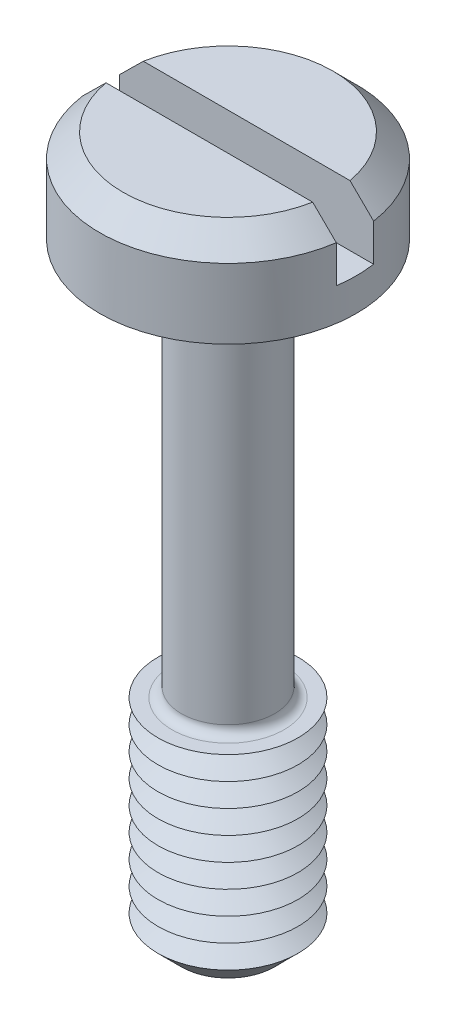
ISO-10303-21;
HEADER;
FILE_DESCRIPTION(('STEP AP214'),'2;1');
FILE_NAME('part.step','',(''),(''),'','','');
FILE_SCHEMA(('AUTOMOTIVE_DESIGN { 1 0 10303 214 1 1 1 1 }'));
ENDSEC;
DATA;
#1=APPLICATION_CONTEXT('core data for automotive mechanical design processes');
#2=APPLICATION_PROTOCOL_DEFINITION('international standard','automotive_design',2000,#1);
#3=PRODUCT_CONTEXT('',#1,'mechanical');
#4=PRODUCT('Part','Part','',(#3));
#5=PRODUCT_RELATED_PRODUCT_CATEGORY('part','',(#4));
#6=PRODUCT_DEFINITION_FORMATION('','',#4);
#7=PRODUCT_DEFINITION_CONTEXT('part definition',#1,'design');
#8=PRODUCT_DEFINITION('design','',#6,#7);
#9=PRODUCT_DEFINITION_SHAPE('','',#8);
#10=(LENGTH_UNIT() NAMED_UNIT(*) SI_UNIT(.MILLI.,.METRE.));
#11=(NAMED_UNIT(*) PLANE_ANGLE_UNIT() SI_UNIT($,.RADIAN.));
#12=(NAMED_UNIT(*) SI_UNIT($,.STERADIAN.) SOLID_ANGLE_UNIT());
#13=UNCERTAINTY_MEASURE_WITH_UNIT(LENGTH_MEASURE(1.E-05),#10,'distance_accuracy_value','');
#14=(GEOMETRIC_REPRESENTATION_CONTEXT(3) GLOBAL_UNCERTAINTY_ASSIGNED_CONTEXT((#13)) GLOBAL_UNIT_ASSIGNED_CONTEXT((#10,
#11,#12)) REPRESENTATION_CONTEXT('',''));
#15=CARTESIAN_POINT('',(0.,0.,0.));
#16=DIRECTION('',(0.,0.,1.));
#17=DIRECTION('',(1.,0.,0.));
#18=AXIS2_PLACEMENT_3D('',#15,#16,#17);
#19=CARTESIAN_POINT('',(0.,2.,0.));
#20=DIRECTION('',(0.,1.,0.));
#21=DIRECTION('',(0.,0.,1.));
#22=AXIS2_PLACEMENT_3D('',#19,#20,#21);
#23=PLANE('',#22);
#24=DIRECTION('',(-1.,0.,0.));
#25=VECTOR('',#24,1.);
#26=CARTESIAN_POINT('',(2.75,2.,-0.4));
#27=LINE('',#26,#25);
#28=CARTESIAN_POINT('',(2.21415898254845,2.,-0.4));
#29=VERTEX_POINT('',#28);
#30=CARTESIAN_POINT('',(-2.21415898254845,2.,-0.4));
#31=VERTEX_POINT('',#30);
#32=EDGE_CURVE('E110',#29,#31,#27,.T.);
#33=ORIENTED_EDGE('',*,*,#32,.F.);
#34=CARTESIAN_POINT('',(0.,2.,0.));
#35=DIRECTION('',(0.,1.,0.));
#36=DIRECTION('',(0.,0.,1.));
#37=AXIS2_PLACEMENT_3D('',#34,#35,#36);
#38=CIRCLE('',#37,2.25);
#39=EDGE_CURVE('E113',#29,#31,#38,.T.);
#40=ORIENTED_EDGE('',*,*,#39,.T.);
#41=EDGE_LOOP('',(#33,#40));
#42=FACE_BOUND('',#41,.T.);
#43=ADVANCED_FACE('F39',(#42),#23,.T.);
#44=CARTESIAN_POINT('',(0.,2.,0.));
#45=DIRECTION('',(0.,-1.,0.));
#46=DIRECTION('',(0.,0.,-1.));
#47=AXIS2_PLACEMENT_3D('',#44,#45,#46);
#48=CONICAL_SURFACE('',#47,2.25,0.785398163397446);
#49=CARTESIAN_POINT('',(6.05060089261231,-1.81380830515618,-0.4));
#50=CARTESIAN_POINT('',(5.84217393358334,-1.60583904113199,-0.4));
#51=CARTESIAN_POINT('',(5.63372707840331,-1.3978896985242,-0.4));
#52=CARTESIAN_POINT('',(5.21676338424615,-0.982052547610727,-0.4));
#53=CARTESIAN_POINT('',(5.00824654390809,-0.774164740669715,-0.4));
#54=CARTESIAN_POINT('',(4.59102343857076,-0.35838342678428,-0.4));
#55=CARTESIAN_POINT('',(4.38231713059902,-0.150489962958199,-0.4));
#56=CARTESIAN_POINT('',(3.96477014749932,0.265153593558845,-0.4));
#57=CARTESIAN_POINT('',(3.75592947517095,0.472903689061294,-0.4));
#58=CARTESIAN_POINT('',(3.33589913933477,0.890287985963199,-0.4));
#59=CARTESIAN_POINT('',(3.12470717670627,1.09991987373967,-0.4));
#60=CARTESIAN_POINT('',(2.70191340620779,1.51879562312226,-0.4));
#61=CARTESIAN_POINT('',(2.49031157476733,1.72803946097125,-0.4));
#62=CARTESIAN_POINT('',(2.17231429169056,2.04123939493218,-0.4));
#63=CARTESIAN_POINT('',(2.06623184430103,2.14551302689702,-0.4));
#64=CARTESIAN_POINT('',(1.85373145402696,2.35372301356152,-0.4));
#65=CARTESIAN_POINT('',(1.7473135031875,2.45765936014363,-0.4));
#66=CARTESIAN_POINT('',(1.53394692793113,2.6649644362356,-0.4));
#67=CARTESIAN_POINT('',(1.42699836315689,2.76833322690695,-0.4));
#68=CARTESIAN_POINT('',(1.26580938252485,2.92258234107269,-0.4));
#69=CARTESIAN_POINT('',(1.21195308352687,2.97386371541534,-0.4));
#70=CARTESIAN_POINT('',(1.10386632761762,3.07603025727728,-0.4));
#71=CARTESIAN_POINT('',(1.0496358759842,3.12691543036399,-0.4));
#72=CARTESIAN_POINT('',(0.96552909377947,3.20495157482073,-0.4));
#73=CARTESIAN_POINT('',(0.935852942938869,3.23231811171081,-0.4));
#74=CARTESIAN_POINT('',(0.876282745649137,3.28681446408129,-0.4));
#75=CARTESIAN_POINT('',(0.846388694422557,3.31394427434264,-0.4));
#76=CARTESIAN_POINT('',(0.786319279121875,3.3678876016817,-0.4));
#77=CARTESIAN_POINT('',(0.756143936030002,3.39470114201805,-0.4));
#78=CARTESIAN_POINT('',(0.695411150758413,3.44788757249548,-0.4));
#79=CARTESIAN_POINT('',(0.664853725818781,3.4742604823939,-0.4));
#80=CARTESIAN_POINT('',(0.58777305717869,3.53947080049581,-0.4));
#81=CARTESIAN_POINT('',(0.540923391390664,3.57793090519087,-0.4));
#82=CARTESIAN_POINT('',(0.469108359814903,3.63368803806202,-0.4));
#83=CARTESIAN_POINT('',(0.4449029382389,3.65195872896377,-0.4));
#84=CARTESIAN_POINT('',(0.395796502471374,3.68753467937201,-0.4));
#85=CARTESIAN_POINT('',(0.370895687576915,3.70484021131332,-0.4));
#86=CARTESIAN_POINT('',(0.315135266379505,3.74129905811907,-0.4));
#87=CARTESIAN_POINT('',(0.284069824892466,3.76014262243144,-0.4));
#88=CARTESIAN_POINT('',(0.220007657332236,3.79429188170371,-0.4));
#89=CARTESIAN_POINT('',(0.187014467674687,3.80960381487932,-0.4));
#90=CARTESIAN_POINT('',(0.12946932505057,3.83013103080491,-0.4));
#91=CARTESIAN_POINT('',(0.105533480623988,3.83700748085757,-0.4));
#92=CARTESIAN_POINT('',(0.0568861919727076,3.84667143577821,-0.4));
#93=CARTESIAN_POINT('',(0.0321777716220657,3.84947323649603,-0.4));
#94=CARTESIAN_POINT('',(-0.0174556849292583,3.85039131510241,-0.4));
#95=CARTESIAN_POINT('',(-0.0423811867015,3.84848412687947,-0.4));
#96=CARTESIAN_POINT('',(-0.0915464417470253,3.8403829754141,-0.4));
#97=CARTESIAN_POINT('',(-0.115784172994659,3.83417751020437,-0.4));
#98=CARTESIAN_POINT('',(-0.16401593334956,3.81830420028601,-0.4));
#99=CARTESIAN_POINT('',(-0.18796977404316,3.80851974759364,-0.4));
#100=CARTESIAN_POINT('',(-0.234812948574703,3.78663483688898,-0.4));
#101=CARTESIAN_POINT('',(-0.257700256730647,3.77453017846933,-0.4));
#102=CARTESIAN_POINT('',(-0.302761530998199,3.74868049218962,-0.4));
#103=CARTESIAN_POINT('',(-0.32492813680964,3.73492286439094,-0.4));
#104=CARTESIAN_POINT('',(-0.368536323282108,3.70635481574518,-0.4));
#105=CARTESIAN_POINT('',(-0.389978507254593,3.69154530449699,-0.4));
#106=CARTESIAN_POINT('',(-0.457169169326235,3.64340388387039,-0.4));
#107=CARTESIAN_POINT('',(-0.501937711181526,3.60871473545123,-0.4));
#108=CARTESIAN_POINT('',(-0.590074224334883,3.53759028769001,-0.4));
#109=CARTESIAN_POINT('',(-0.633441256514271,3.50115385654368,-0.4));
#110=CARTESIAN_POINT('',(-0.719371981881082,3.42718980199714,-0.4));
#111=CARTESIAN_POINT('',(-0.761934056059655,3.3896603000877,-0.4));
#112=CARTESIAN_POINT('',(-0.846465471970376,3.31396862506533,-0.4));
#113=CARTESIAN_POINT('',(-0.888434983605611,3.27580664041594,-0.4));
#114=CARTESIAN_POINT('',(-1.01351008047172,3.16091722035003,-0.4));
#115=CARTESIAN_POINT('',(-1.09603733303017,3.0835613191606,-0.4));
#116=CARTESIAN_POINT('',(-1.26020205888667,2.92809304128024,-0.4));
#117=CARTESIAN_POINT('',(-1.34184039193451,2.84998156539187,-0.4));
#118=CARTESIAN_POINT('',(-1.50425180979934,2.69362860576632,-0.4));
#119=CARTESIAN_POINT('',(-1.58502715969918,2.61538947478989,-0.4));
#120=CARTESIAN_POINT('',(-1.74627332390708,2.45859784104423,-0.4));
#121=CARTESIAN_POINT('',(-1.82674413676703,2.38004533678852,-0.4));
#122=CARTESIAN_POINT('',(-2.06785619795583,2.14407469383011,-0.4));
#123=CARTESIAN_POINT('',(-2.22819388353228,1.98634651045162,-0.4));
#124=CARTESIAN_POINT('',(-2.54852691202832,1.67040441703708,-0.4));
#125=CARTESIAN_POINT('',(-2.70852207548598,1.51219032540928,-0.4));
#126=CARTESIAN_POINT('',(-3.02826273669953,1.19551306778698,-0.4));
#127=CARTESIAN_POINT('',(-3.18800823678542,1.03704990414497,-0.4));
#128=CARTESIAN_POINT('',(-3.66699080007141,0.561455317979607,-0.4));
#129=CARTESIAN_POINT('',(-3.9859992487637,0.244093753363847,-0.4));
#130=CARTESIAN_POINT('',(-4.6236988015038,-0.390879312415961,-0.4));
#131=CARTESIAN_POINT('',(-4.94238993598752,-0.70849078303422,-0.4));
#132=CARTESIAN_POINT('',(-5.39262624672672,-1.15743192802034,-0.4));
#133=CARTESIAN_POINT('',(-5.52423897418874,-1.28869385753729,-0.4));
#134=CARTESIAN_POINT('',(-5.78743776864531,-1.5512369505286,-0.4));
#135=CARTESIAN_POINT('',(-5.91902383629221,-1.68251811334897,-0.4));
#136=CARTESIAN_POINT('',(-6.05060089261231,-1.81380830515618,-0.4));
#137=B_SPLINE_CURVE_WITH_KNOTS('',3,(#49,#50,#51,#52,#53,#54,#55,#56,#57,#58,#59,#60,#61,#62,
#63,#64,#65,#66,#67,#68,#69,#70,#71,#72,#73,#74,#75,#76,#77,#78,#79,#80,#81,#82,#83,#84,#85,#86,
#87,#88,#89,#90,#91,#92,#93,#94,#95,#96,#97,#98,#99,#100,#101,#102,#103,#104,#105,#106,#107,
#108,#109,#110,#111,#112,#113,#114,#115,#116,#117,#118,#119,#120,#121,#122,#123,#124,#125,#126,
#127,#128,#129,#130,#131,#132,#133,#134,#135,#136),.UNSPECIFIED.,.F.,.F.,(4,2,2,2,2,2,2,2,2,2,2,
2,2,2,2,2,2,2,2,2,2,2,2,2,2,2,2,2,2,2,2,2,2,2,2,2,2,2,2,2,2,2,2,4),(0.,0.88331033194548,
1.76663897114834,2.65038219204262,3.53410755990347,4.42681573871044,5.31957687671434,
5.76582544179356,6.21208466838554,6.65829482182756,6.88139126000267,7.10448455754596,
7.22558850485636,7.34669511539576,7.46779276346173,7.58888496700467,7.77066509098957,
7.86163037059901,7.95256984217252,8.06146372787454,8.17016376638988,8.24461141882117,
8.31879723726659,8.39335348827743,8.46811002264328,8.54555790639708,8.62314734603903,
8.70137101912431,8.77952785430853,8.94932745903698,9.1192385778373,9.28946128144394,
9.45963414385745,9.79895964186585,10.1379210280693,10.475282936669,10.8126464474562,
11.4873867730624,12.1624208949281,12.8374486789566,14.1873973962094,15.5372009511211,
16.0948428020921,16.6524687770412),.UNSPECIFIED.);
#138=CARTESIAN_POINT('',(2.72075357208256,1.5,-0.4));
#139=VERTEX_POINT('',#138);
#140=EDGE_CURVE('E260',#139,#29,#137,.T.);
#141=ORIENTED_EDGE('',*,*,#140,.F.);
#142=CARTESIAN_POINT('',(0.,1.5,0.));
#143=DIRECTION('',(0.,1.,0.));
#144=DIRECTION('',(0.,0.,1.));
#145=AXIS2_PLACEMENT_3D('',#142,#143,#144);
#146=CIRCLE('',#145,2.75);
#147=CARTESIAN_POINT('',(-2.72075357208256,1.5,-0.4));
#148=VERTEX_POINT('',#147);
#149=EDGE_CURVE('E128',#148,#139,#146,.F.);
#150=ORIENTED_EDGE('',*,*,#149,.F.);
#151=EDGE_CURVE('E102',#31,#148,#137,.T.);
#152=ORIENTED_EDGE('',*,*,#151,.F.);
#153=ORIENTED_EDGE('',*,*,#39,.F.);
#154=EDGE_LOOP('',(#141,#150,#152,#153));
#155=FACE_BOUND('',#154,.T.);
#156=ADVANCED_FACE('F222',(#155),#48,.T.);
#157=CARTESIAN_POINT('',(0.,-13.,0.));
#158=DIRECTION('',(0.,1.,0.));
#159=DIRECTION('',(0.,0.,1.));
#160=AXIS2_PLACEMENT_3D('',#157,#158,#159);
#161=CYLINDRICAL_SURFACE('',#160,1.);
#162=CARTESIAN_POINT('',(0.,-8.3,0.));
#163=DIRECTION('',(0.,-1.,0.));
#164=DIRECTION('',(0.,0.,-1.));
#165=AXIS2_PLACEMENT_3D('',#162,#163,#164);
#166=CIRCLE('',#165,1.);
#167=CARTESIAN_POINT('',(0.,-8.3,1.));
#168=VERTEX_POINT('',#167);
#169=EDGE_CURVE('E123',#168,#168,#166,.F.);
#170=CARTESIAN_POINT('',(0.,-0.200000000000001,0.));
#171=DIRECTION('',(0.,1.,0.));
#172=DIRECTION('',(0.,0.,1.));
#173=AXIS2_PLACEMENT_3D('',#170,#171,#172);
#174=CIRCLE('',#173,1.);
#175=CARTESIAN_POINT('',(0.,-0.200000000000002,1.));
#176=VERTEX_POINT('',#175);
#177=EDGE_CURVE('E365',#176,#176,#174,.F.);
#178=CARTESIAN_POINT('',(0.,-8.3,1.));
#179=CARTESIAN_POINT('',(0.,-8.215625,1.));
#180=CARTESIAN_POINT('',(0.,-8.13125,1.));
#181=CARTESIAN_POINT('',(0.,-7.9625,1.));
#182=CARTESIAN_POINT('',(0.,-7.878125,1.));
#183=CARTESIAN_POINT('',(0.,-7.709375,1.));
#184=CARTESIAN_POINT('',(0.,-7.625,1.));
#185=CARTESIAN_POINT('',(0.,-7.45625,1.));
#186=CARTESIAN_POINT('',(0.,-7.371875,1.));
#187=CARTESIAN_POINT('',(0.,-7.203125,1.));
#188=CARTESIAN_POINT('',(0.,-7.11875,1.));
#189=CARTESIAN_POINT('',(0.,-6.95,1.));
#190=CARTESIAN_POINT('',(0.,-6.865625,1.));
#191=CARTESIAN_POINT('',(0.,-6.696875,1.));
#192=CARTESIAN_POINT('',(0.,-6.6125,1.));
#193=CARTESIAN_POINT('',(0.,-6.44375,1.));
#194=CARTESIAN_POINT('',(0.,-6.359375,1.));
#195=CARTESIAN_POINT('',(0.,-6.190625,1.));
#196=CARTESIAN_POINT('',(0.,-6.10625,1.));
#197=CARTESIAN_POINT('',(0.,-5.9375,1.));
#198=CARTESIAN_POINT('',(0.,-5.853125,1.));
#199=CARTESIAN_POINT('',(0.,-5.684375,1.));
#200=CARTESIAN_POINT('',(0.,-5.6,1.));
#201=CARTESIAN_POINT('',(0.,-5.43125,1.));
#202=CARTESIAN_POINT('',(0.,-5.346875,1.));
#203=CARTESIAN_POINT('',(0.,-5.178125,1.));
#204=CARTESIAN_POINT('',(0.,-5.09375,1.));
#205=CARTESIAN_POINT('',(0.,-4.925,1.));
#206=CARTESIAN_POINT('',(0.,-4.840625,1.));
#207=CARTESIAN_POINT('',(0.,-4.671875,1.));
#208=CARTESIAN_POINT('',(0.,-4.5875,1.));
#209=CARTESIAN_POINT('',(0.,-4.41875,1.));
#210=CARTESIAN_POINT('',(0.,-4.334375,1.));
#211=CARTESIAN_POINT('',(0.,-4.165625,1.));
#212=CARTESIAN_POINT('',(0.,-4.08125,1.));
#213=CARTESIAN_POINT('',(0.,-3.9125,1.));
#214=CARTESIAN_POINT('',(0.,-3.828125,1.));
#215=CARTESIAN_POINT('',(0.,-3.659375,1.));
#216=CARTESIAN_POINT('',(0.,-3.575,1.));
#217=CARTESIAN_POINT('',(0.,-3.40625,1.));
#218=CARTESIAN_POINT('',(0.,-3.321875,1.));
#219=CARTESIAN_POINT('',(0.,-3.153125,1.));
#220=CARTESIAN_POINT('',(0.,-3.06875,1.));
#221=CARTESIAN_POINT('',(0.,-2.9,1.));
#222=CARTESIAN_POINT('',(0.,-2.815625,1.));
#223=CARTESIAN_POINT('',(0.,-2.646875,1.));
#224=CARTESIAN_POINT('',(0.,-2.5625,1.));
#225=CARTESIAN_POINT('',(0.,-2.39375,1.));
#226=CARTESIAN_POINT('',(0.,-2.309375,1.));
#227=CARTESIAN_POINT('',(0.,-2.140625,1.));
#228=CARTESIAN_POINT('',(0.,-2.05625,1.));
#229=CARTESIAN_POINT('',(0.,-1.8875,1.));
#230=CARTESIAN_POINT('',(0.,-1.803125,1.));
#231=CARTESIAN_POINT('',(0.,-1.634375,1.));
#232=CARTESIAN_POINT('',(0.,-1.55,1.));
#233=CARTESIAN_POINT('',(0.,-1.38125,1.));
#234=CARTESIAN_POINT('',(0.,-1.296875,1.));
#235=CARTESIAN_POINT('',(0.,-1.128125,1.));
#236=CARTESIAN_POINT('',(0.,-1.04375,1.));
#237=CARTESIAN_POINT('',(0.,-0.875000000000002,1.));
#238=CARTESIAN_POINT('',(0.,-0.790625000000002,1.));
#239=CARTESIAN_POINT('',(0.,-0.621875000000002,1.));
#240=CARTESIAN_POINT('',(0.,-0.537500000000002,1.));
#241=CARTESIAN_POINT('',(0.,-0.368750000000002,1.));
#242=CARTESIAN_POINT('',(0.,-0.284375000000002,1.));
#243=CARTESIAN_POINT('',(0.,-0.200000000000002,1.));
#244=B_SPLINE_CURVE_WITH_KNOTS('',3,(#178,#179,#180,#181,#182,#183,#184,#185,#186,#187,#188,
#189,#190,#191,#192,#193,#194,#195,#196,#197,#198,#199,#200,#201,#202,#203,#204,#205,#206,#207,
#208,#209,#210,#211,#212,#213,#214,#215,#216,#217,#218,#219,#220,#221,#222,#223,#224,#225,#226,
#227,#228,#229,#230,#231,#232,#233,#234,#235,#236,#237,#238,#239,#240,#241,#242,#243),
.UNSPECIFIED.,.F.,.F.,(4,2,2,2,2,2,2,2,2,2,2,2,2,2,2,2,2,2,2,2,2,2,2,2,2,2,2,2,2,2,2,2,4),(0.,
0.253125,0.506249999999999,0.759374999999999,1.0125,1.265625,1.51875,1.771875,2.025,2.278125,
2.53125,2.784375,3.0375,3.290625,3.54375,3.796875,4.05,4.303125,4.55625,4.809375,5.0625,
5.315625,5.56875,5.821875,6.075,6.328125,6.58125,6.834375,7.0875,7.340625,7.59375,7.846875,8.1),.UNSPECIFIED.);
#245=EDGE_CURVE('BSEAM218',#168,#176,#244,.T.);
#246=ORIENTED_EDGE('',*,*,#169,.T.);
#247=ORIENTED_EDGE('',*,*,#177,.T.);
#248=ORIENTED_EDGE('',*,*,#245,.T.);
#249=ORIENTED_EDGE('',*,*,#245,.F.);
#250=EDGE_LOOP('',(#246,#248,#247,#249));
#251=FACE_BOUND('',#250,.T.);
#252=ADVANCED_FACE('F218',(#251),#161,.T.);
#253=CARTESIAN_POINT('',(0.,2.,0.));
#254=DIRECTION('',(0.,-1.,0.));
#255=DIRECTION('',(0.,0.,-1.));
#256=AXIS2_PLACEMENT_3D('',#253,#254,#255);
#257=CYLINDRICAL_SURFACE('',#256,2.75);
#258=ORIENTED_EDGE('',*,*,#149,.T.);
#259=DIRECTION('',(0.,-1.,0.));
#260=VECTOR('',#259,1.);
#261=CARTESIAN_POINT('',(2.72075357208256,2.,-0.4));
#262=LINE('',#261,#260);
#263=CARTESIAN_POINT('',(2.72075357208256,0.7,-0.4));
#264=VERTEX_POINT('',#263);
#265=EDGE_CURVE('E64',#139,#264,#262,.T.);
#266=ORIENTED_EDGE('',*,*,#265,.T.);
#267=CARTESIAN_POINT('',(0.,0.7,0.));
#268=DIRECTION('',(0.,1.,0.));
#269=DIRECTION('',(0.,0.,1.));
#270=AXIS2_PLACEMENT_3D('',#267,#268,#269);
#271=CIRCLE('',#270,2.75);
#272=CARTESIAN_POINT('',(2.72075357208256,0.7,0.4));
#273=VERTEX_POINT('',#272);
#274=EDGE_CURVE('E11',#273,#264,#271,.T.);
#275=ORIENTED_EDGE('',*,*,#274,.F.);
#276=DIRECTION('',(0.,-1.,0.));
#277=VECTOR('',#276,1.);
#278=CARTESIAN_POINT('',(2.72075357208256,2.,0.4));
#279=LINE('',#278,#277);
#280=CARTESIAN_POINT('',(2.72075357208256,1.5,0.4));
#281=VERTEX_POINT('',#280);
#282=EDGE_CURVE('E279',#273,#281,#279,.F.);
#283=ORIENTED_EDGE('',*,*,#282,.T.);
#284=CARTESIAN_POINT('',(-2.72075357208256,1.5,0.4));
#285=VERTEX_POINT('',#284);
#286=EDGE_CURVE('E120',#281,#285,#146,.F.);
#287=ORIENTED_EDGE('',*,*,#286,.T.);
#288=DIRECTION('',(0.,-1.,0.));
#289=VECTOR('',#288,1.);
#290=CARTESIAN_POINT('',(-2.72075357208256,2.,0.4));
#291=LINE('',#290,#289);
#292=CARTESIAN_POINT('',(-2.72075357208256,0.7,0.4));
#293=VERTEX_POINT('',#292);
#294=EDGE_CURVE('E96',#285,#293,#291,.T.);
#295=ORIENTED_EDGE('',*,*,#294,.T.);
#296=CARTESIAN_POINT('',(-2.72075357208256,0.7,-0.4));
#297=VERTEX_POINT('',#296);
#298=EDGE_CURVE('E44',#297,#293,#271,.T.);
#299=ORIENTED_EDGE('',*,*,#298,.F.);
#300=DIRECTION('',(0.,-1.,0.));
#301=VECTOR('',#300,1.);
#302=CARTESIAN_POINT('',(-2.72075357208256,2.,-0.4));
#303=LINE('',#302,#301);
#304=EDGE_CURVE('E283',#297,#148,#303,.F.);
#305=ORIENTED_EDGE('',*,*,#304,.T.);
#306=EDGE_LOOP('',(#258,#266,#275,#283,#287,#295,#299,#305));
#307=FACE_BOUND('',#306,.T.);
#308=CARTESIAN_POINT('',(0.,0.,0.));
#309=DIRECTION('',(0.,1.,0.));
#310=DIRECTION('',(0.,0.,1.));
#311=AXIS2_PLACEMENT_3D('',#308,#309,#310);
#312=CIRCLE('',#311,2.75);
#313=CARTESIAN_POINT('',(0.,0.,2.75));
#314=VERTEX_POINT('',#313);
#315=EDGE_CURVE('E354',#314,#314,#312,.T.);
#316=ORIENTED_EDGE('',*,*,#315,.T.);
#317=EDGE_LOOP('',(#316));
#318=FACE_BOUND('',#317,.T.);
#319=ADVANCED_FACE('F221',(#307,#318),#257,.T.);
#320=DIRECTION('',(1.,0.,0.));
#321=VECTOR('',#320,1.);
#322=CARTESIAN_POINT('',(2.75,2.,0.4));
#323=LINE('',#322,#321);
#324=CARTESIAN_POINT('',(-2.21415898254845,2.,0.4));
#325=VERTEX_POINT('',#324);
#326=CARTESIAN_POINT('',(2.21415898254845,2.,0.4));
#327=VERTEX_POINT('',#326);
#328=EDGE_CURVE('E56',#325,#327,#323,.T.);
#329=ORIENTED_EDGE('',*,*,#328,.F.);
#330=EDGE_CURVE('E108',#325,#327,#38,.T.);
#331=ORIENTED_EDGE('',*,*,#330,.T.);
#332=EDGE_LOOP('',(#329,#331));
#333=FACE_BOUND('',#332,.T.);
#334=ADVANCED_FACE('F107',(#333),#23,.T.);
#335=CARTESIAN_POINT('',(0.,0.,0.));
#336=DIRECTION('',(0.,1.,0.));
#337=DIRECTION('',(0.,0.,1.));
#338=AXIS2_PLACEMENT_3D('',#335,#336,#337);
#339=PLANE('',#338);
#340=CARTESIAN_POINT('',(0.,0.,0.));
#341=DIRECTION('',(0.,1.,0.));
#342=DIRECTION('',(0.,0.,1.));
#343=AXIS2_PLACEMENT_3D('',#340,#341,#342);
#344=CIRCLE('',#343,1.2);
#345=CARTESIAN_POINT('',(0.,0.,1.2));
#346=VERTEX_POINT('',#345);
#347=EDGE_CURVE('E114',#346,#346,#344,.T.);
#348=ORIENTED_EDGE('',*,*,#347,.T.);
#349=EDGE_LOOP('',(#348));
#350=FACE_BOUND('',#349,.T.);
#351=ORIENTED_EDGE('',*,*,#315,.F.);
#352=EDGE_LOOP('',(#351));
#353=FACE_BOUND('',#352,.T.);
#354=ADVANCED_FACE('F212',(#350,#353),#339,.F.);
#355=CARTESIAN_POINT('',(0.,-8.5,0.));
#356=DIRECTION('',(0.,-1.,0.));
#357=DIRECTION('',(0.,0.,-1.));
#358=AXIS2_PLACEMENT_3D('',#355,#356,#357);
#359=PLANE('',#358);
#360=CARTESIAN_POINT('',(0.,-8.5,0.));
#361=DIRECTION('',(0.,-1.,0.));
#362=DIRECTION('',(0.,0.,-1.));
#363=AXIS2_PLACEMENT_3D('',#360,#361,#362);
#364=CIRCLE('',#363,1.2);
#365=CARTESIAN_POINT('',(0.,-8.5,-1.2));
#366=VERTEX_POINT('',#365);
#367=EDGE_CURVE('E361',#366,#366,#364,.T.);
#368=ORIENTED_EDGE('',*,*,#367,.T.);
#369=EDGE_LOOP('',(#368));
#370=FACE_BOUND('',#369,.T.);
#371=CARTESIAN_POINT('',(0.,-8.5,0.));
#372=DIRECTION('',(0.,1.,0.));
#373=DIRECTION('',(0.,0.,1.));
#374=AXIS2_PLACEMENT_3D('',#371,#372,#373);
#375=CIRCLE('',#374,1.5);
#376=CARTESIAN_POINT('',(0.,-8.5,1.5));
#377=VERTEX_POINT('',#376);
#378=EDGE_CURVE('E350',#377,#377,#375,.T.);
#379=ORIENTED_EDGE('',*,*,#378,.T.);
#380=EDGE_LOOP('',(#379));
#381=FACE_BOUND('',#380,.T.);
#382=ADVANCED_FACE('F208',(#370,#381),#359,.F.);
#383=CARTESIAN_POINT('',(0.,-8.75,0.));
#384=DIRECTION('',(0.,1.,0.));
#385=DIRECTION('',(0.,0.,1.));
#386=AXIS2_PLACEMENT_3D('',#383,#384,#385);
#387=CONICAL_SURFACE('',#386,1.06698729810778,1.0471975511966);
#388=ORIENTED_EDGE('',*,*,#378,.F.);
#389=EDGE_LOOP('',(#388));
#390=FACE_BOUND('',#389,.T.);
#391=CARTESIAN_POINT('',(0.,-8.75,0.));
#392=DIRECTION('',(0.,1.,0.));
#393=DIRECTION('',(0.,0.,1.));
#394=AXIS2_PLACEMENT_3D('',#391,#392,#393);
#395=CIRCLE('',#394,1.06698729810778);
#396=CARTESIAN_POINT('',(0.,-8.75,1.06698729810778));
#397=VERTEX_POINT('',#396);
#398=EDGE_CURVE('E346',#397,#397,#395,.T.);
#399=ORIENTED_EDGE('',*,*,#398,.T.);
#400=EDGE_LOOP('',(#399));
#401=FACE_BOUND('',#400,.T.);
#402=ADVANCED_FACE('F204',(#390,#401),#387,.T.);
#403=CARTESIAN_POINT('',(0.,-9.,0.));
#404=DIRECTION('',(0.,-1.,0.));
#405=DIRECTION('',(0.,0.,-1.));
#406=AXIS2_PLACEMENT_3D('',#403,#404,#405);
#407=CONICAL_SURFACE('',#406,1.5,1.0471975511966);
#408=ORIENTED_EDGE('',*,*,#398,.F.);
#409=EDGE_LOOP('',(#408));
#410=FACE_BOUND('',#409,.T.);
#411=CARTESIAN_POINT('',(0.,-9.,0.));
#412=DIRECTION('',(0.,1.,0.));
#413=DIRECTION('',(0.,0.,1.));
#414=AXIS2_PLACEMENT_3D('',#411,#412,#413);
#415=CIRCLE('',#414,1.5);
#416=CARTESIAN_POINT('',(0.,-9.,1.5));
#417=VERTEX_POINT('',#416);
#418=EDGE_CURVE('E343',#417,#417,#415,.T.);
#419=ORIENTED_EDGE('',*,*,#418,.T.);
#420=EDGE_LOOP('',(#419));
#421=FACE_BOUND('',#420,.T.);
#422=ADVANCED_FACE('F200',(#410,#421),#407,.T.);
#423=CARTESIAN_POINT('',(0.,-9.25,0.));
#424=DIRECTION('',(0.,1.,0.));
#425=DIRECTION('',(0.,0.,1.));
#426=AXIS2_PLACEMENT_3D('',#423,#424,#425);
#427=CONICAL_SURFACE('',#426,1.06698729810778,1.0471975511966);
#428=ORIENTED_EDGE('',*,*,#418,.F.);
#429=EDGE_LOOP('',(#428));
#430=FACE_BOUND('',#429,.T.);
#431=CARTESIAN_POINT('',(0.,-9.25,0.));
#432=DIRECTION('',(0.,1.,0.));
#433=DIRECTION('',(0.,0.,1.));
#434=AXIS2_PLACEMENT_3D('',#431,#432,#433);
#435=CIRCLE('',#434,1.06698729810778);
#436=CARTESIAN_POINT('',(0.,-9.25,1.06698729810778));
#437=VERTEX_POINT('',#436);
#438=EDGE_CURVE('E340',#437,#437,#435,.T.);
#439=ORIENTED_EDGE('',*,*,#438,.T.);
#440=EDGE_LOOP('',(#439));
#441=FACE_BOUND('',#440,.T.);
#442=ADVANCED_FACE('F196',(#430,#441),#427,.T.);
#443=CARTESIAN_POINT('',(0.,-9.5,0.));
#444=DIRECTION('',(0.,-1.,0.));
#445=DIRECTION('',(0.,0.,-1.));
#446=AXIS2_PLACEMENT_3D('',#443,#444,#445);
#447=CONICAL_SURFACE('',#446,1.5,1.0471975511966);
#448=ORIENTED_EDGE('',*,*,#438,.F.);
#449=EDGE_LOOP('',(#448));
#450=FACE_BOUND('',#449,.T.);
#451=CARTESIAN_POINT('',(0.,-9.5,0.));
#452=DIRECTION('',(0.,1.,0.));
#453=DIRECTION('',(0.,0.,1.));
#454=AXIS2_PLACEMENT_3D('',#451,#452,#453);
#455=CIRCLE('',#454,1.5);
#456=CARTESIAN_POINT('',(0.,-9.5,1.5));
#457=VERTEX_POINT('',#456);
#458=EDGE_CURVE('E337',#457,#457,#455,.T.);
#459=ORIENTED_EDGE('',*,*,#458,.T.);
#460=EDGE_LOOP('',(#459));
#461=FACE_BOUND('',#460,.T.);
#462=ADVANCED_FACE('F192',(#450,#461),#447,.T.);
#463=CARTESIAN_POINT('',(0.,-9.75,0.));
#464=DIRECTION('',(0.,1.,0.));
#465=DIRECTION('',(0.,0.,1.));
#466=AXIS2_PLACEMENT_3D('',#463,#464,#465);
#467=CONICAL_SURFACE('',#466,1.06698729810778,1.0471975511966);
#468=ORIENTED_EDGE('',*,*,#458,.F.);
#469=EDGE_LOOP('',(#468));
#470=FACE_BOUND('',#469,.T.);
#471=CARTESIAN_POINT('',(0.,-9.75,0.));
#472=DIRECTION('',(0.,1.,0.));
#473=DIRECTION('',(0.,0.,1.));
#474=AXIS2_PLACEMENT_3D('',#471,#472,#473);
#475=CIRCLE('',#474,1.06698729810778);
#476=CARTESIAN_POINT('',(0.,-9.75,1.06698729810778));
#477=VERTEX_POINT('',#476);
#478=EDGE_CURVE('E333',#477,#477,#475,.T.);
#479=ORIENTED_EDGE('',*,*,#478,.T.);
#480=EDGE_LOOP('',(#479));
#481=FACE_BOUND('',#480,.T.);
#482=ADVANCED_FACE('F188',(#470,#481),#467,.T.);
#483=CARTESIAN_POINT('',(0.,-10.,0.));
#484=DIRECTION('',(0.,-1.,0.));
#485=DIRECTION('',(0.,0.,-1.));
#486=AXIS2_PLACEMENT_3D('',#483,#484,#485);
#487=CONICAL_SURFACE('',#486,1.5,1.0471975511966);
#488=ORIENTED_EDGE('',*,*,#478,.F.);
#489=EDGE_LOOP('',(#488));
#490=FACE_BOUND('',#489,.T.);
#491=CARTESIAN_POINT('',(0.,-10.,0.));
#492=DIRECTION('',(0.,1.,0.));
#493=DIRECTION('',(0.,0.,1.));
#494=AXIS2_PLACEMENT_3D('',#491,#492,#493);
#495=CIRCLE('',#494,1.5);
#496=CARTESIAN_POINT('',(0.,-10.,1.5));
#497=VERTEX_POINT('',#496);
#498=EDGE_CURVE('E330',#497,#497,#495,.T.);
#499=ORIENTED_EDGE('',*,*,#498,.T.);
#500=EDGE_LOOP('',(#499));
#501=FACE_BOUND('',#500,.T.);
#502=ADVANCED_FACE('F184',(#490,#501),#487,.T.);
#503=CARTESIAN_POINT('',(0.,-10.25,0.));
#504=DIRECTION('',(0.,1.,0.));
#505=DIRECTION('',(0.,0.,1.));
#506=AXIS2_PLACEMENT_3D('',#503,#504,#505);
#507=CONICAL_SURFACE('',#506,1.06698729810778,1.0471975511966);
#508=ORIENTED_EDGE('',*,*,#498,.F.);
#509=EDGE_LOOP('',(#508));
#510=FACE_BOUND('',#509,.T.);
#511=CARTESIAN_POINT('',(0.,-10.25,0.));
#512=DIRECTION('',(0.,1.,0.));
#513=DIRECTION('',(0.,0.,1.));
#514=AXIS2_PLACEMENT_3D('',#511,#512,#513);
#515=CIRCLE('',#514,1.06698729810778);
#516=CARTESIAN_POINT('',(0.,-10.25,1.06698729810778));
#517=VERTEX_POINT('',#516);
#518=EDGE_CURVE('E326',#517,#517,#515,.T.);
#519=ORIENTED_EDGE('',*,*,#518,.T.);
#520=EDGE_LOOP('',(#519));
#521=FACE_BOUND('',#520,.T.);
#522=ADVANCED_FACE('F180',(#510,#521),#507,.T.);
#523=CARTESIAN_POINT('',(0.,-10.5,0.));
#524=DIRECTION('',(0.,-1.,0.));
#525=DIRECTION('',(0.,0.,-1.));
#526=AXIS2_PLACEMENT_3D('',#523,#524,#525);
#527=CONICAL_SURFACE('',#526,1.5,1.0471975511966);
#528=ORIENTED_EDGE('',*,*,#518,.F.);
#529=EDGE_LOOP('',(#528));
#530=FACE_BOUND('',#529,.T.);
#531=CARTESIAN_POINT('',(0.,-10.5,0.));
#532=DIRECTION('',(0.,1.,0.));
#533=DIRECTION('',(0.,0.,1.));
#534=AXIS2_PLACEMENT_3D('',#531,#532,#533);
#535=CIRCLE('',#534,1.5);
#536=CARTESIAN_POINT('',(0.,-10.5,1.5));
#537=VERTEX_POINT('',#536);
#538=EDGE_CURVE('E322',#537,#537,#535,.T.);
#539=ORIENTED_EDGE('',*,*,#538,.T.);
#540=EDGE_LOOP('',(#539));
#541=FACE_BOUND('',#540,.T.);
#542=ADVANCED_FACE('F176',(#530,#541),#527,.T.);
#543=CARTESIAN_POINT('',(0.,-10.75,0.));
#544=DIRECTION('',(0.,1.,0.));
#545=DIRECTION('',(0.,0.,1.));
#546=AXIS2_PLACEMENT_3D('',#543,#544,#545);
#547=CONICAL_SURFACE('',#546,1.06698729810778,1.0471975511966);
#548=ORIENTED_EDGE('',*,*,#538,.F.);
#549=EDGE_LOOP('',(#548));
#550=FACE_BOUND('',#549,.T.);
#551=CARTESIAN_POINT('',(0.,-10.75,0.));
#552=DIRECTION('',(0.,1.,0.));
#553=DIRECTION('',(0.,0.,1.));
#554=AXIS2_PLACEMENT_3D('',#551,#552,#553);
#555=CIRCLE('',#554,1.06698729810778);
#556=CARTESIAN_POINT('',(0.,-10.75,1.06698729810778));
#557=VERTEX_POINT('',#556);
#558=EDGE_CURVE('E318',#557,#557,#555,.T.);
#559=ORIENTED_EDGE('',*,*,#558,.T.);
#560=EDGE_LOOP('',(#559));
#561=FACE_BOUND('',#560,.T.);
#562=ADVANCED_FACE('F172',(#550,#561),#547,.T.);
#563=CARTESIAN_POINT('',(0.,-11.,0.));
#564=DIRECTION('',(0.,-1.,0.));
#565=DIRECTION('',(0.,0.,-1.));
#566=AXIS2_PLACEMENT_3D('',#563,#564,#565);
#567=CONICAL_SURFACE('',#566,1.5,1.0471975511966);
#568=ORIENTED_EDGE('',*,*,#558,.F.);
#569=EDGE_LOOP('',(#568));
#570=FACE_BOUND('',#569,.T.);
#571=CARTESIAN_POINT('',(0.,-11.,0.));
#572=DIRECTION('',(0.,1.,0.));
#573=DIRECTION('',(0.,0.,1.));
#574=AXIS2_PLACEMENT_3D('',#571,#572,#573);
#575=CIRCLE('',#574,1.5);
#576=CARTESIAN_POINT('',(0.,-11.,1.5));
#577=VERTEX_POINT('',#576);
#578=EDGE_CURVE('E315',#577,#577,#575,.T.);
#579=ORIENTED_EDGE('',*,*,#578,.T.);
#580=EDGE_LOOP('',(#579));
#581=FACE_BOUND('',#580,.T.);
#582=ADVANCED_FACE('F168',(#570,#581),#567,.T.);
#583=CARTESIAN_POINT('',(0.,-11.25,0.));
#584=DIRECTION('',(0.,1.,0.));
#585=DIRECTION('',(0.,0.,1.));
#586=AXIS2_PLACEMENT_3D('',#583,#584,#585);
#587=CONICAL_SURFACE('',#586,1.06698729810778,1.0471975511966);
#588=ORIENTED_EDGE('',*,*,#578,.F.);
#589=EDGE_LOOP('',(#588));
#590=FACE_BOUND('',#589,.T.);
#591=CARTESIAN_POINT('',(0.,-11.25,0.));
#592=DIRECTION('',(0.,1.,0.));
#593=DIRECTION('',(0.,0.,1.));
#594=AXIS2_PLACEMENT_3D('',#591,#592,#593);
#595=CIRCLE('',#594,1.06698729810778);
#596=CARTESIAN_POINT('',(0.,-11.25,1.06698729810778));
#597=VERTEX_POINT('',#596);
#598=EDGE_CURVE('E311',#597,#597,#595,.T.);
#599=ORIENTED_EDGE('',*,*,#598,.T.);
#600=EDGE_LOOP('',(#599));
#601=FACE_BOUND('',#600,.T.);
#602=ADVANCED_FACE('F164',(#590,#601),#587,.T.);
#603=CARTESIAN_POINT('',(0.,-11.5,0.));
#604=DIRECTION('',(0.,-1.,0.));
#605=DIRECTION('',(0.,0.,-1.));
#606=AXIS2_PLACEMENT_3D('',#603,#604,#605);
#607=CONICAL_SURFACE('',#606,1.5,1.0471975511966);
#608=ORIENTED_EDGE('',*,*,#598,.F.);
#609=EDGE_LOOP('',(#608));
#610=FACE_BOUND('',#609,.T.);
#611=CARTESIAN_POINT('',(0.,-11.5,0.));
#612=DIRECTION('',(0.,1.,0.));
#613=DIRECTION('',(0.,0.,1.));
#614=AXIS2_PLACEMENT_3D('',#611,#612,#613);
#615=CIRCLE('',#614,1.5);
#616=CARTESIAN_POINT('',(0.,-11.5,1.5));
#617=VERTEX_POINT('',#616);
#618=EDGE_CURVE('E308',#617,#617,#615,.T.);
#619=ORIENTED_EDGE('',*,*,#618,.T.);
#620=EDGE_LOOP('',(#619));
#621=FACE_BOUND('',#620,.T.);
#622=ADVANCED_FACE('F160',(#610,#621),#607,.T.);
#623=CARTESIAN_POINT('',(0.,-11.75,0.));
#624=DIRECTION('',(0.,1.,0.));
#625=DIRECTION('',(0.,0.,1.));
#626=AXIS2_PLACEMENT_3D('',#623,#624,#625);
#627=CONICAL_SURFACE('',#626,1.06698729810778,1.0471975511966);
#628=ORIENTED_EDGE('',*,*,#618,.F.);
#629=EDGE_LOOP('',(#628));
#630=FACE_BOUND('',#629,.T.);
#631=CARTESIAN_POINT('',(0.,-11.75,0.));
#632=DIRECTION('',(0.,1.,0.));
#633=DIRECTION('',(0.,0.,1.));
#634=AXIS2_PLACEMENT_3D('',#631,#632,#633);
#635=CIRCLE('',#634,1.06698729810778);
#636=CARTESIAN_POINT('',(0.,-11.75,1.06698729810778));
#637=VERTEX_POINT('',#636);
#638=EDGE_CURVE('E304',#637,#637,#635,.T.);
#639=ORIENTED_EDGE('',*,*,#638,.T.);
#640=EDGE_LOOP('',(#639));
#641=FACE_BOUND('',#640,.T.);
#642=ADVANCED_FACE('F156',(#630,#641),#627,.T.);
#643=CARTESIAN_POINT('',(0.,-12.,0.));
#644=DIRECTION('',(0.,-1.,0.));
#645=DIRECTION('',(0.,0.,-1.));
#646=AXIS2_PLACEMENT_3D('',#643,#644,#645);
#647=CONICAL_SURFACE('',#646,1.5,1.0471975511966);
#648=ORIENTED_EDGE('',*,*,#638,.F.);
#649=EDGE_LOOP('',(#648));
#650=FACE_BOUND('',#649,.T.);
#651=CARTESIAN_POINT('',(0.,-12.,0.));
#652=DIRECTION('',(0.,1.,0.));
#653=DIRECTION('',(0.,0.,1.));
#654=AXIS2_PLACEMENT_3D('',#651,#652,#653);
#655=CIRCLE('',#654,1.5);
#656=CARTESIAN_POINT('',(0.,-12.,1.5));
#657=VERTEX_POINT('',#656);
#658=EDGE_CURVE('E301',#657,#657,#655,.T.);
#659=ORIENTED_EDGE('',*,*,#658,.T.);
#660=EDGE_LOOP('',(#659));
#661=FACE_BOUND('',#660,.T.);
#662=ADVANCED_FACE('F152',(#650,#661),#647,.T.);
#663=CARTESIAN_POINT('',(0.,-12.25,0.));
#664=DIRECTION('',(0.,1.,0.));
#665=DIRECTION('',(0.,0.,1.));
#666=AXIS2_PLACEMENT_3D('',#663,#664,#665);
#667=CONICAL_SURFACE('',#666,1.06698729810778,1.0471975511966);
#668=ORIENTED_EDGE('',*,*,#658,.F.);
#669=EDGE_LOOP('',(#668));
#670=FACE_BOUND('',#669,.T.);
#671=CARTESIAN_POINT('',(0.,-12.25,0.));
#672=DIRECTION('',(0.,1.,0.));
#673=DIRECTION('',(0.,0.,1.));
#674=AXIS2_PLACEMENT_3D('',#671,#672,#673);
#675=CIRCLE('',#674,1.06698729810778);
#676=CARTESIAN_POINT('',(0.,-12.25,1.06698729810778));
#677=VERTEX_POINT('',#676);
#678=EDGE_CURVE('E297',#677,#677,#675,.T.);
#679=ORIENTED_EDGE('',*,*,#678,.T.);
#680=EDGE_LOOP('',(#679));
#681=FACE_BOUND('',#680,.T.);
#682=ADVANCED_FACE('F148',(#670,#681),#667,.T.);
#683=CARTESIAN_POINT('',(0.,-12.5,0.));
#684=DIRECTION('',(0.,-1.,0.));
#685=DIRECTION('',(0.,0.,-1.));
#686=AXIS2_PLACEMENT_3D('',#683,#684,#685);
#687=CONICAL_SURFACE('',#686,1.5,1.0471975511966);
#688=ORIENTED_EDGE('',*,*,#678,.F.);
#689=EDGE_LOOP('',(#688));
#690=FACE_BOUND('',#689,.T.);
#691=CARTESIAN_POINT('',(0.,-12.5,0.));
#692=DIRECTION('',(0.,1.,0.));
#693=DIRECTION('',(0.,0.,1.));
#694=AXIS2_PLACEMENT_3D('',#691,#692,#693);
#695=CIRCLE('',#694,1.5);
#696=CARTESIAN_POINT('',(0.,-12.5,1.5));
#697=VERTEX_POINT('',#696);
#698=EDGE_CURVE('E293',#697,#697,#695,.T.);
#699=ORIENTED_EDGE('',*,*,#698,.T.);
#700=EDGE_LOOP('',(#699));
#701=FACE_BOUND('',#700,.T.);
#702=ADVANCED_FACE('F144',(#690,#701),#687,.T.);
#703=CARTESIAN_POINT('',(0.,-13.,0.));
#704=DIRECTION('',(0.,-1.,0.));
#705=DIRECTION('',(0.,0.,-1.));
#706=AXIS2_PLACEMENT_3D('',#703,#704,#705);
#707=PLANE('',#706);
#708=CARTESIAN_POINT('',(0.,-13.,0.));
#709=DIRECTION('',(0.,-1.,0.));
#710=DIRECTION('',(0.,0.,-1.));
#711=AXIS2_PLACEMENT_3D('',#708,#709,#710);
#712=CIRCLE('',#711,0.999999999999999);
#713=CARTESIAN_POINT('',(0.,-13.,-0.999999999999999));
#714=VERTEX_POINT('',#713);
#715=EDGE_CURVE('E357',#714,#714,#712,.T.);
#716=ORIENTED_EDGE('',*,*,#715,.T.);
#717=EDGE_LOOP('',(#716));
#718=FACE_BOUND('',#717,.T.);
#719=ADVANCED_FACE('F147',(#718),#707,.T.);
#720=CARTESIAN_POINT('',(0.,-13.,0.));
#721=DIRECTION('',(0.,1.,0.));
#722=DIRECTION('',(0.,0.,1.));
#723=AXIS2_PLACEMENT_3D('',#720,#721,#722);
#724=CONICAL_SURFACE('',#723,0.999999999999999,0.785398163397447);
#725=ORIENTED_EDGE('',*,*,#698,.F.);
#726=EDGE_LOOP('',(#725));
#727=FACE_BOUND('',#726,.T.);
#728=ORIENTED_EDGE('',*,*,#715,.F.);
#729=EDGE_LOOP('',(#728));
#730=FACE_BOUND('',#729,.T.);
#731=ADVANCED_FACE('F216',(#727,#730),#724,.T.);
#732=CARTESIAN_POINT('',(0.,-8.3,0.));
#733=DIRECTION('',(0.,-1.,0.));
#734=DIRECTION('',(0.,0.,-1.));
#735=AXIS2_PLACEMENT_3D('',#732,#733,#734);
#736=TOROIDAL_SURFACE('',#735,1.2,0.2);
#737=ORIENTED_EDGE('',*,*,#169,.F.);
#738=EDGE_LOOP('',(#737));
#739=FACE_BOUND('',#738,.T.);
#740=ORIENTED_EDGE('',*,*,#367,.F.);
#741=EDGE_LOOP('',(#740));
#742=FACE_BOUND('',#741,.T.);
#743=ADVANCED_FACE('F234',(#739,#742),#736,.F.);
#744=CARTESIAN_POINT('',(0.,-0.200000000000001,0.));
#745=DIRECTION('',(0.,1.,0.));
#746=DIRECTION('',(0.,0.,1.));
#747=AXIS2_PLACEMENT_3D('',#744,#745,#746);
#748=TOROIDAL_SURFACE('',#747,1.2,0.2);
#749=ORIENTED_EDGE('',*,*,#347,.F.);
#750=EDGE_LOOP('',(#749));
#751=FACE_BOUND('',#750,.T.);
#752=ORIENTED_EDGE('',*,*,#177,.F.);
#753=EDGE_LOOP('',(#752));
#754=FACE_BOUND('',#753,.T.);
#755=ADVANCED_FACE('F237',(#751,#754),#748,.F.);
#756=CARTESIAN_POINT('',(-6.05060089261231,-1.81380830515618,0.4));
#757=CARTESIAN_POINT('',(-5.84217393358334,-1.60583904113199,0.4));
#758=CARTESIAN_POINT('',(-5.63372707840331,-1.3978896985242,0.4));
#759=CARTESIAN_POINT('',(-5.21676338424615,-0.982052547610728,0.4));
#760=CARTESIAN_POINT('',(-5.00824654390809,-0.774164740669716,0.4));
#761=CARTESIAN_POINT('',(-4.59102343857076,-0.358383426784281,0.4));
#762=CARTESIAN_POINT('',(-4.38231713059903,-0.150489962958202,0.4));
#763=CARTESIAN_POINT('',(-3.96477014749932,0.265153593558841,0.4));
#764=CARTESIAN_POINT('',(-3.75592947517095,0.47290368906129,0.4));
#765=CARTESIAN_POINT('',(-3.33589913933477,0.890287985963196,0.4));
#766=CARTESIAN_POINT('',(-3.12470717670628,1.09991987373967,0.4));
#767=CARTESIAN_POINT('',(-2.7019134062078,1.51879562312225,0.4));
#768=CARTESIAN_POINT('',(-2.49031157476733,1.72803946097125,0.4));
#769=CARTESIAN_POINT('',(-2.17231429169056,2.04123939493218,0.4));
#770=CARTESIAN_POINT('',(-2.06623184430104,2.14551302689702,0.4));
#771=CARTESIAN_POINT('',(-1.85373145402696,2.35372301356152,0.4));
#772=CARTESIAN_POINT('',(-1.7473135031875,2.45765936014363,0.4));
#773=CARTESIAN_POINT('',(-1.53394692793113,2.6649644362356,0.4));
#774=CARTESIAN_POINT('',(-1.42699836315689,2.76833322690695,0.4));
#775=CARTESIAN_POINT('',(-1.26580938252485,2.92258234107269,0.4));
#776=CARTESIAN_POINT('',(-1.21195308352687,2.97386371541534,0.4));
#777=CARTESIAN_POINT('',(-1.10386632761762,3.07603025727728,0.4));
#778=CARTESIAN_POINT('',(-1.0496358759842,3.12691543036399,0.4));
#779=CARTESIAN_POINT('',(-0.96552909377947,3.20495157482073,0.4));
#780=CARTESIAN_POINT('',(-0.935852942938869,3.23231811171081,0.4));
#781=CARTESIAN_POINT('',(-0.876282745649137,3.28681446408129,0.4));
#782=CARTESIAN_POINT('',(-0.846388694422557,3.31394427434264,0.4));
#783=CARTESIAN_POINT('',(-0.786319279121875,3.3678876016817,0.4));
#784=CARTESIAN_POINT('',(-0.756143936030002,3.39470114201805,0.4));
#785=CARTESIAN_POINT('',(-0.695411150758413,3.44788757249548,0.4));
#786=CARTESIAN_POINT('',(-0.664853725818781,3.4742604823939,0.4));
#787=CARTESIAN_POINT('',(-0.58777305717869,3.53947080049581,0.4));
#788=CARTESIAN_POINT('',(-0.540923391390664,3.57793090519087,0.4));
#789=CARTESIAN_POINT('',(-0.469108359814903,3.63368803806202,0.4));
#790=CARTESIAN_POINT('',(-0.4449029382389,3.65195872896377,0.4));
#791=CARTESIAN_POINT('',(-0.395796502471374,3.68753467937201,0.4));
#792=CARTESIAN_POINT('',(-0.370895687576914,3.70484021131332,0.4));
#793=CARTESIAN_POINT('',(-0.315135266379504,3.74129905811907,0.4));
#794=CARTESIAN_POINT('',(-0.284069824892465,3.76014262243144,0.4));
#795=CARTESIAN_POINT('',(-0.220007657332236,3.79429188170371,0.4));
#796=CARTESIAN_POINT('',(-0.187014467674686,3.80960381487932,0.4));
#797=CARTESIAN_POINT('',(-0.12946932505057,3.83013103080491,0.4));
#798=CARTESIAN_POINT('',(-0.105533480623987,3.83700748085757,0.4));
#799=CARTESIAN_POINT('',(-0.0568861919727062,3.84667143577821,0.4));
#800=CARTESIAN_POINT('',(-0.0321777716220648,3.84947323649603,0.4));
#801=CARTESIAN_POINT('',(0.0174556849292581,3.85039131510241,0.4));
#802=CARTESIAN_POINT('',(0.0423811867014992,3.84848412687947,0.4));
#803=CARTESIAN_POINT('',(0.0915464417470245,3.8403829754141,0.4));
#804=CARTESIAN_POINT('',(0.115784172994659,3.83417751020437,0.4));
#805=CARTESIAN_POINT('',(0.16401593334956,3.81830420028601,0.4));
#806=CARTESIAN_POINT('',(0.18796977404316,3.80851974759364,0.4));
#807=CARTESIAN_POINT('',(0.234812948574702,3.78663483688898,0.4));
#808=CARTESIAN_POINT('',(0.257700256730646,3.77453017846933,0.4));
#809=CARTESIAN_POINT('',(0.302761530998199,3.74868049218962,0.4));
#810=CARTESIAN_POINT('',(0.32492813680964,3.73492286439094,0.4));
#811=CARTESIAN_POINT('',(0.368536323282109,3.70635481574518,0.4));
#812=CARTESIAN_POINT('',(0.389978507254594,3.69154530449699,0.4));
#813=CARTESIAN_POINT('',(0.457169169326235,3.64340388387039,0.4));
#814=CARTESIAN_POINT('',(0.501937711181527,3.60871473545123,0.4));
#815=CARTESIAN_POINT('',(0.590074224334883,3.53759028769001,0.4));
#816=CARTESIAN_POINT('',(0.633441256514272,3.50115385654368,0.4));
#817=CARTESIAN_POINT('',(0.719371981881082,3.42718980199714,0.4));
#818=CARTESIAN_POINT('',(0.761934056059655,3.3896603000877,0.4));
#819=CARTESIAN_POINT('',(0.846465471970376,3.31396862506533,0.4));
#820=CARTESIAN_POINT('',(0.888434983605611,3.27580664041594,0.4));
#821=CARTESIAN_POINT('',(1.01351008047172,3.16091722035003,0.4));
#822=CARTESIAN_POINT('',(1.09603733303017,3.0835613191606,0.4));
#823=CARTESIAN_POINT('',(1.26020205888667,2.92809304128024,0.4));
#824=CARTESIAN_POINT('',(1.34184039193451,2.84998156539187,0.4));
#825=CARTESIAN_POINT('',(1.50425180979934,2.69362860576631,0.4));
#826=CARTESIAN_POINT('',(1.58502715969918,2.61538947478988,0.4));
#827=CARTESIAN_POINT('',(1.74627332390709,2.45859784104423,0.4));
#828=CARTESIAN_POINT('',(1.82674413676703,2.38004533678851,0.4));
#829=CARTESIAN_POINT('',(2.06785619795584,2.1440746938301,0.4));
#830=CARTESIAN_POINT('',(2.22819388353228,1.98634651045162,0.4));
#831=CARTESIAN_POINT('',(2.54852691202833,1.67040441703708,0.4));
#832=CARTESIAN_POINT('',(2.70852207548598,1.51219032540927,0.4));
#833=CARTESIAN_POINT('',(3.02826273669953,1.19551306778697,0.4));
#834=CARTESIAN_POINT('',(3.18800823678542,1.03704990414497,0.4));
#835=CARTESIAN_POINT('',(3.66699080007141,0.561455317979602,0.4));
#836=CARTESIAN_POINT('',(3.9859992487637,0.244093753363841,0.4));
#837=CARTESIAN_POINT('',(4.62369880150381,-0.390879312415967,0.4));
#838=CARTESIAN_POINT('',(4.94238993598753,-0.708490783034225,0.4));
#839=CARTESIAN_POINT('',(5.39262624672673,-1.15743192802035,0.4));
#840=CARTESIAN_POINT('',(5.52423897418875,-1.2886938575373,0.4));
#841=CARTESIAN_POINT('',(5.78743776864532,-1.5512369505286,0.4));
#842=CARTESIAN_POINT('',(5.91902383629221,-1.68251811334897,0.4));
#843=CARTESIAN_POINT('',(6.05060089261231,-1.81380830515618,0.4));
#844=B_SPLINE_CURVE_WITH_KNOTS('',3,(#756,#757,#758,#759,#760,#761,#762,#763,#764,#765,#766,
#767,#768,#769,#770,#771,#772,#773,#774,#775,#776,#777,#778,#779,#780,#781,#782,#783,#784,#785,
#786,#787,#788,#789,#790,#791,#792,#793,#794,#795,#796,#797,#798,#799,#800,#801,#802,#803,#804,
#805,#806,#807,#808,#809,#810,#811,#812,#813,#814,#815,#816,#817,#818,#819,#820,#821,#822,#823,
#824,#825,#826,#827,#828,#829,#830,#831,#832,#833,#834,#835,#836,#837,#838,#839,#840,#841,#842,
#843),.UNSPECIFIED.,.F.,.F.,(4,2,2,2,2,2,2,2,2,2,2,2,2,2,2,2,2,2,2,2,2,2,2,2,2,2,2,2,2,2,2,2,2,
2,2,2,2,2,2,2,2,2,2,4),(0.,0.883310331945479,1.76663897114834,2.65038219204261,3.53410755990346,
4.42681573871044,5.31957687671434,5.76582544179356,6.21208466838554,6.65829482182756,
6.88139126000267,7.10448455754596,7.22558850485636,7.34669511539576,7.46779276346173,
7.58888496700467,7.77066509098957,7.86163037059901,7.95256984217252,8.06146372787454,
8.17016376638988,8.24461141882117,8.31879723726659,8.39335348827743,8.46811002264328,
8.54555790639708,8.62314734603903,8.70137101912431,8.77952785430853,8.94932745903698,
9.1192385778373,9.28946128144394,9.45963414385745,9.79895964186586,10.1379210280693,
10.475282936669,10.8126464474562,11.4873867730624,12.1624208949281,12.8374486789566,
14.1873973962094,15.5372009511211,16.0948428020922,16.6524687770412),.UNSPECIFIED.);
#845=EDGE_CURVE('E92',#285,#325,#844,.T.);
#846=ORIENTED_EDGE('',*,*,#845,.F.);
#847=ORIENTED_EDGE('',*,*,#286,.F.);
#848=EDGE_CURVE('E103',#327,#281,#844,.T.);
#849=ORIENTED_EDGE('',*,*,#848,.F.);
#850=ORIENTED_EDGE('',*,*,#330,.F.);
#851=EDGE_LOOP('',(#846,#847,#849,#850));
#852=FACE_BOUND('',#851,.T.);
#853=ADVANCED_FACE('F41',(#852),#48,.T.);
#854=CARTESIAN_POINT('',(0.,0.7,0.));
#855=DIRECTION('',(0.,1.,0.));
#856=DIRECTION('',(0.,0.,1.));
#857=AXIS2_PLACEMENT_3D('',#854,#855,#856);
#858=PLANE('',#857);
#859=DIRECTION('',(1.,0.,0.));
#860=VECTOR('',#859,1.);
#861=CARTESIAN_POINT('',(2.75,0.7,0.4));
#862=LINE('',#861,#860);
#863=EDGE_CURVE('E257',#293,#273,#862,.T.);
#864=ORIENTED_EDGE('',*,*,#863,.T.);
#865=ORIENTED_EDGE('',*,*,#274,.T.);
#866=DIRECTION('',(-1.,0.,0.));
#867=VECTOR('',#866,1.);
#868=CARTESIAN_POINT('',(2.75,0.7,-0.4));
#869=LINE('',#868,#867);
#870=EDGE_CURVE('E276',#264,#297,#869,.T.);
#871=ORIENTED_EDGE('',*,*,#870,.T.);
#872=ORIENTED_EDGE('',*,*,#298,.T.);
#873=EDGE_LOOP('',(#864,#865,#871,#872));
#874=FACE_BOUND('',#873,.T.);
#875=ADVANCED_FACE('F244',(#874),#858,.T.);
#876=CARTESIAN_POINT('',(2.75,0.7,-0.4));
#877=DIRECTION('',(0.,0.,-1.));
#878=DIRECTION('',(-1.,0.,0.));
#879=AXIS2_PLACEMENT_3D('',#876,#877,#878);
#880=PLANE('',#879);
#881=ORIENTED_EDGE('',*,*,#140,.T.);
#882=ORIENTED_EDGE('',*,*,#32,.T.);
#883=ORIENTED_EDGE('',*,*,#151,.T.);
#884=ORIENTED_EDGE('',*,*,#304,.F.);
#885=ORIENTED_EDGE('',*,*,#870,.F.);
#886=ORIENTED_EDGE('',*,*,#265,.F.);
#887=EDGE_LOOP('',(#881,#882,#883,#884,#885,#886));
#888=FACE_BOUND('',#887,.T.);
#889=ADVANCED_FACE('F141',(#888),#880,.F.);
#890=CARTESIAN_POINT('',(2.75,0.7,0.4));
#891=DIRECTION('',(0.,0.,1.));
#892=DIRECTION('',(1.,0.,0.));
#893=AXIS2_PLACEMENT_3D('',#890,#891,#892);
#894=PLANE('',#893);
#895=ORIENTED_EDGE('',*,*,#845,.T.);
#896=ORIENTED_EDGE('',*,*,#328,.T.);
#897=ORIENTED_EDGE('',*,*,#848,.T.);
#898=ORIENTED_EDGE('',*,*,#282,.F.);
#899=ORIENTED_EDGE('',*,*,#863,.F.);
#900=ORIENTED_EDGE('',*,*,#294,.F.);
#901=EDGE_LOOP('',(#895,#896,#897,#898,#899,#900));
#902=FACE_BOUND('',#901,.T.);
#903=ADVANCED_FACE('F93',(#902),#894,.F.);
#904=CLOSED_SHELL('',(#43,#156,#252,#319,#334,#354,#382,#402,#422,#442,#462,#482,#502,#522,#542,
#562,#582,#602,#622,#642,#662,#682,#702,#719,#731,#743,#755,#853,#875,#889,#903));
#905=MANIFOLD_SOLID_BREP('B2',#904);
#906=ADVANCED_BREP_SHAPE_REPRESENTATION('',(#18,#905),#14);
#907=SHAPE_DEFINITION_REPRESENTATION(#9,#906);
ENDSEC;
END-ISO-10303-21;
